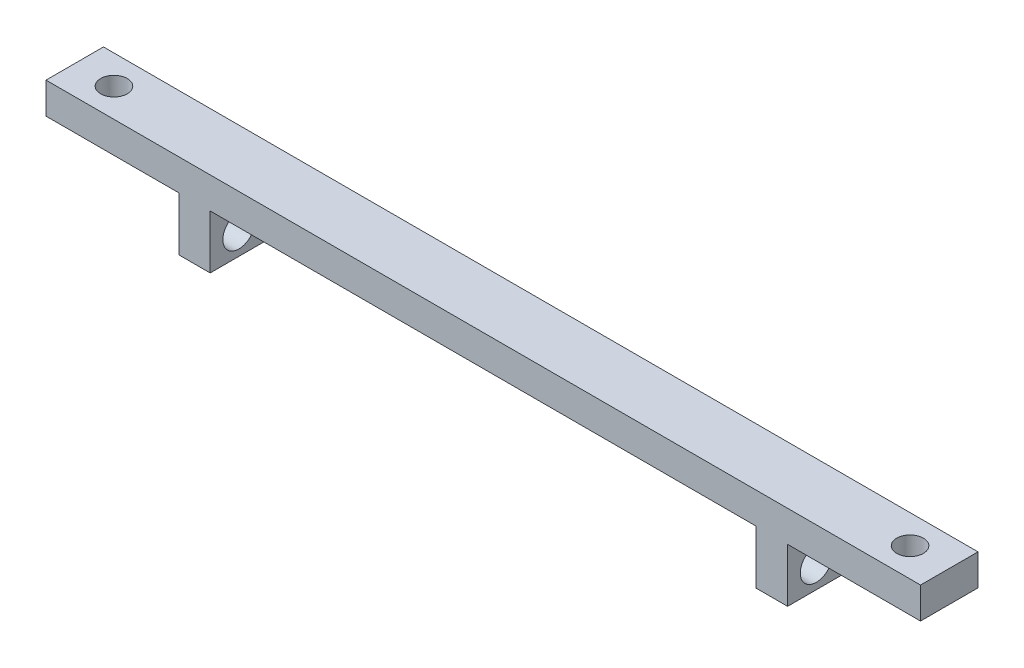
from build123d import *

# Parameters (mm, degrees)
SKETCH1_W                    = 88.9
SKETCH1_H                    = 8.636
EXTRUDE1_DEPTH               = 5.842
SKETCH2_W                    = 13.5128
SKETCH2_H                    = 5.461
SKETCH2_W_2                  = 55.499
EXTRUDE3_DEPTH               = 5.842
F_6_32_TAPPED_HOLE1_D        = 2.7051
F_30_0_1285_DIAMETER_HOLE1_D = 3.2639


with BuildPart() as part:
    # Sketch1 → Extrude1 (new body)
    with BuildSketch(Plane.XY):
        with Locations((44.45, 4.318)):
            Rectangle(SKETCH1_W, SKETCH1_H)
    extrude(amount=-EXTRUDE1_DEPTH)

    # Sketch2 → Extrude3 (cut)
    with BuildSketch(Plane.XY):
        with Locations((6.7564, 2.7305)):
            Rectangle(SKETCH2_W, SKETCH2_H)
        with Locations((44.4373, 2.7305)):
            Rectangle(SKETCH2_W_2, SKETCH2_H)
        with Locations((82.1436, 2.7305)):
            Rectangle(SKETCH2_W, SKETCH2_H)
    extrude(amount=-EXTRUDE3_DEPTH, mode=Mode.SUBTRACT)

    # 6-32 Tapped Hole1 (through all)
    with Locations(Plane(origin=(3.9878, 8.636, -2.921), x_dir=(0, 0, 1), z_dir=(0, 1, 0))):
        with Locations((0, 0), (0, 80.9244)):
            Hole(F_6_32_TAPPED_HOLE1_D / 2)

    # 30 _0.1285_ Diameter Hole1 (through all)
    with Locations(Plane(origin=(75.3872, 2.286, -2.921), x_dir=(0, 0, 1), z_dir=(1, 0, 0))):
        with Locations((0, 0)):
            Hole(F_30_0_1285_DIAMETER_HOLE1_D / 2)


solid = part.part
